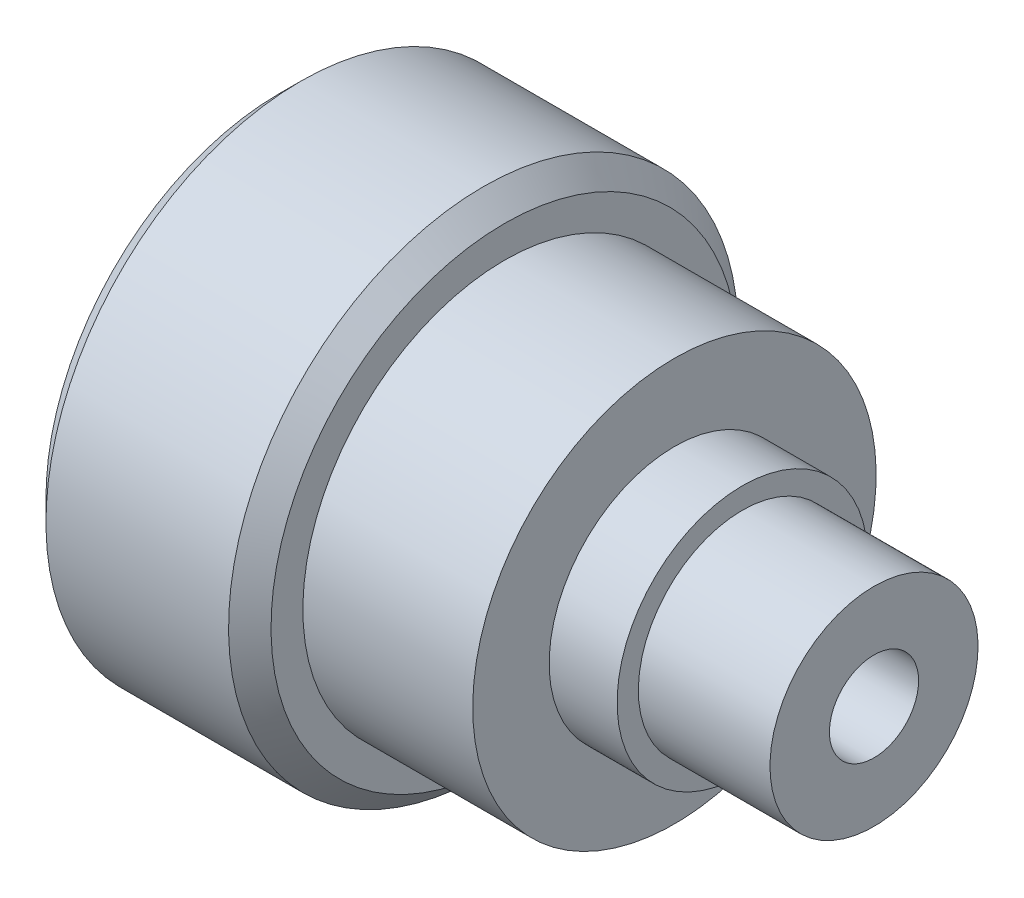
ISO-10303-21;
HEADER;
FILE_DESCRIPTION(('STEP AP214'),'2;1');
FILE_NAME('part.step','',(''),(''),'','','');
FILE_SCHEMA(('AUTOMOTIVE_DESIGN { 1 0 10303 214 1 1 1 1 }'));
ENDSEC;
DATA;
#1=APPLICATION_CONTEXT('core data for automotive mechanical design processes');
#2=APPLICATION_PROTOCOL_DEFINITION('international standard','automotive_design',2000,#1);
#3=PRODUCT_CONTEXT('',#1,'mechanical');
#4=PRODUCT('Part','Part','',(#3));
#5=PRODUCT_RELATED_PRODUCT_CATEGORY('part','',(#4));
#6=PRODUCT_DEFINITION_FORMATION('','',#4);
#7=PRODUCT_DEFINITION_CONTEXT('part definition',#1,'design');
#8=PRODUCT_DEFINITION('design','',#6,#7);
#9=PRODUCT_DEFINITION_SHAPE('','',#8);
#10=(LENGTH_UNIT() NAMED_UNIT(*) SI_UNIT(.MILLI.,.METRE.));
#11=(NAMED_UNIT(*) PLANE_ANGLE_UNIT() SI_UNIT($,.RADIAN.));
#12=(NAMED_UNIT(*) SI_UNIT($,.STERADIAN.) SOLID_ANGLE_UNIT());
#13=UNCERTAINTY_MEASURE_WITH_UNIT(LENGTH_MEASURE(1.E-05),#10,'distance_accuracy_value','');
#14=(GEOMETRIC_REPRESENTATION_CONTEXT(3) GLOBAL_UNCERTAINTY_ASSIGNED_CONTEXT((#13)) GLOBAL_UNIT_ASSIGNED_CONTEXT((#10,
#11,#12)) REPRESENTATION_CONTEXT('',''));
#15=CARTESIAN_POINT('',(0.,0.,0.));
#16=DIRECTION('',(0.,0.,1.));
#17=DIRECTION('',(1.,0.,0.));
#18=AXIS2_PLACEMENT_3D('',#15,#16,#17);
#19=CARTESIAN_POINT('',(1.,0.,0.));
#20=DIRECTION('',(1.,0.,0.));
#21=DIRECTION('',(0.,1.,0.));
#22=AXIS2_PLACEMENT_3D('',#19,#20,#21);
#23=CONICAL_SURFACE('',#22,12.,0.785398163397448);
#24=CARTESIAN_POINT('',(0.,0.,0.));
#25=DIRECTION('',(1.,0.,0.));
#26=DIRECTION('',(0.,1.,0.));
#27=AXIS2_PLACEMENT_3D('',#24,#25,#26);
#28=CIRCLE('',#27,11.);
#29=CARTESIAN_POINT('',(0.,11.,0.));
#30=VERTEX_POINT('',#29);
#31=EDGE_CURVE('E69',#30,#30,#28,.T.);
#32=ORIENTED_EDGE('',*,*,#31,.T.);
#33=EDGE_LOOP('',(#32));
#34=FACE_BOUND('',#33,.T.);
#35=CARTESIAN_POINT('',(1.,0.,0.));
#36=DIRECTION('',(1.,0.,0.));
#37=DIRECTION('',(0.,1.,0.));
#38=AXIS2_PLACEMENT_3D('',#35,#36,#37);
#39=CIRCLE('',#38,12.);
#40=CARTESIAN_POINT('',(1.,12.,0.));
#41=VERTEX_POINT('',#40);
#42=EDGE_CURVE('E10',#41,#41,#39,.T.);
#43=ORIENTED_EDGE('',*,*,#42,.F.);
#44=EDGE_LOOP('',(#43));
#45=FACE_BOUND('',#44,.T.);
#46=ADVANCED_FACE('F29',(#34,#45),#23,.T.);
#47=CARTESIAN_POINT('',(28.,0.,0.));
#48=DIRECTION('',(1.,0.,0.));
#49=DIRECTION('',(0.,1.,0.));
#50=AXIS2_PLACEMENT_3D('',#47,#48,#49);
#51=CYLINDRICAL_SURFACE('',#50,12.);
#52=ORIENTED_EDGE('',*,*,#42,.T.);
#53=EDGE_LOOP('',(#52));
#54=FACE_BOUND('',#53,.T.);
#55=CARTESIAN_POINT('',(9.6,0.,0.));
#56=DIRECTION('',(1.,0.,0.));
#57=DIRECTION('',(0.,1.,0.));
#58=AXIS2_PLACEMENT_3D('',#55,#56,#57);
#59=CIRCLE('',#58,12.);
#60=CARTESIAN_POINT('',(9.6,12.,0.));
#61=VERTEX_POINT('',#60);
#62=EDGE_CURVE('E35',#61,#61,#59,.T.);
#63=ORIENTED_EDGE('',*,*,#62,.F.);
#64=EDGE_LOOP('',(#63));
#65=FACE_BOUND('',#64,.T.);
#66=ADVANCED_FACE('F100',(#54,#65),#51,.T.);
#67=CARTESIAN_POINT('',(10.6,0.,0.));
#68=DIRECTION('',(-1.,0.,0.));
#69=DIRECTION('',(0.,-1.,0.));
#70=AXIS2_PLACEMENT_3D('',#67,#68,#69);
#71=CONICAL_SURFACE('',#70,11.,0.785398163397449);
#72=ORIENTED_EDGE('',*,*,#62,.T.);
#73=EDGE_LOOP('',(#72));
#74=FACE_BOUND('',#73,.T.);
#75=CARTESIAN_POINT('',(10.6,0.,0.));
#76=DIRECTION('',(1.,0.,0.));
#77=DIRECTION('',(0.,1.,0.));
#78=AXIS2_PLACEMENT_3D('',#75,#76,#77);
#79=CIRCLE('',#78,11.);
#80=CARTESIAN_POINT('',(10.6,11.,0.));
#81=VERTEX_POINT('',#80);
#82=EDGE_CURVE('E39',#81,#81,#79,.T.);
#83=ORIENTED_EDGE('',*,*,#82,.F.);
#84=EDGE_LOOP('',(#83));
#85=FACE_BOUND('',#84,.T.);
#86=ADVANCED_FACE('F105',(#74,#85),#71,.T.);
#87=CARTESIAN_POINT('',(10.6,11.,0.));
#88=DIRECTION('',(1.,0.,0.));
#89=DIRECTION('',(0.,1.,0.));
#90=AXIS2_PLACEMENT_3D('',#87,#88,#89);
#91=PLANE('',#90);
#92=ORIENTED_EDGE('',*,*,#82,.T.);
#93=EDGE_LOOP('',(#92));
#94=FACE_BOUND('',#93,.T.);
#95=CARTESIAN_POINT('',(10.6,0.,0.));
#96=DIRECTION('',(1.,0.,0.));
#97=DIRECTION('',(0.,1.,0.));
#98=AXIS2_PLACEMENT_3D('',#95,#96,#97);
#99=CIRCLE('',#98,9.5);
#100=CARTESIAN_POINT('',(10.6,9.5,0.));
#101=VERTEX_POINT('',#100);
#102=EDGE_CURVE('E43',#101,#101,#99,.T.);
#103=ORIENTED_EDGE('',*,*,#102,.F.);
#104=EDGE_LOOP('',(#103));
#105=FACE_BOUND('',#104,.T.);
#106=ADVANCED_FACE('F187',(#94,#105),#91,.T.);
#107=CARTESIAN_POINT('',(28.,0.,0.));
#108=DIRECTION('',(1.,0.,0.));
#109=DIRECTION('',(0.,1.,0.));
#110=AXIS2_PLACEMENT_3D('',#107,#108,#109);
#111=CYLINDRICAL_SURFACE('',#110,9.5);
#112=ORIENTED_EDGE('',*,*,#102,.T.);
#113=EDGE_LOOP('',(#112));
#114=FACE_BOUND('',#113,.T.);
#115=CARTESIAN_POINT('',(18.6,0.,0.));
#116=DIRECTION('',(1.,0.,0.));
#117=DIRECTION('',(0.,1.,0.));
#118=AXIS2_PLACEMENT_3D('',#115,#116,#117);
#119=CIRCLE('',#118,9.5);
#120=CARTESIAN_POINT('',(18.6,9.5,0.));
#121=VERTEX_POINT('',#120);
#122=EDGE_CURVE('E48',#121,#121,#119,.T.);
#123=ORIENTED_EDGE('',*,*,#122,.F.);
#124=EDGE_LOOP('',(#123));
#125=FACE_BOUND('',#124,.T.);
#126=ADVANCED_FACE('F178',(#114,#125),#111,.T.);
#127=CARTESIAN_POINT('',(18.6,9.5,0.));
#128=DIRECTION('',(1.,0.,0.));
#129=DIRECTION('',(0.,1.,0.));
#130=AXIS2_PLACEMENT_3D('',#127,#128,#129);
#131=PLANE('',#130);
#132=ORIENTED_EDGE('',*,*,#122,.T.);
#133=EDGE_LOOP('',(#132));
#134=FACE_BOUND('',#133,.T.);
#135=CARTESIAN_POINT('',(18.6,0.,0.));
#136=DIRECTION('',(1.,0.,0.));
#137=DIRECTION('',(0.,1.,0.));
#138=AXIS2_PLACEMENT_3D('',#135,#136,#137);
#139=CIRCLE('',#138,5.89999999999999);
#140=CARTESIAN_POINT('',(18.6,5.89999999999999,0.));
#141=VERTEX_POINT('',#140);
#142=EDGE_CURVE('E51',#141,#141,#139,.T.);
#143=ORIENTED_EDGE('',*,*,#142,.F.);
#144=EDGE_LOOP('',(#143));
#145=FACE_BOUND('',#144,.T.);
#146=ADVANCED_FACE('F169',(#134,#145),#131,.T.);
#147=CARTESIAN_POINT('',(28.,0.,0.));
#148=DIRECTION('',(1.,0.,0.));
#149=DIRECTION('',(0.,1.,0.));
#150=AXIS2_PLACEMENT_3D('',#147,#148,#149);
#151=CYLINDRICAL_SURFACE('',#150,5.89999999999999);
#152=ORIENTED_EDGE('',*,*,#142,.T.);
#153=EDGE_LOOP('',(#152));
#154=FACE_BOUND('',#153,.T.);
#155=CARTESIAN_POINT('',(21.8,0.,0.));
#156=DIRECTION('',(1.,0.,0.));
#157=DIRECTION('',(0.,1.,0.));
#158=AXIS2_PLACEMENT_3D('',#155,#156,#157);
#159=CIRCLE('',#158,5.89999999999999);
#160=CARTESIAN_POINT('',(21.8,5.89999999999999,0.));
#161=VERTEX_POINT('',#160);
#162=EDGE_CURVE('E54',#161,#161,#159,.T.);
#163=ORIENTED_EDGE('',*,*,#162,.F.);
#164=EDGE_LOOP('',(#163));
#165=FACE_BOUND('',#164,.T.);
#166=ADVANCED_FACE('F96',(#154,#165),#151,.T.);
#167=CARTESIAN_POINT('',(21.8,5.89999999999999,0.));
#168=DIRECTION('',(1.,0.,0.));
#169=DIRECTION('',(0.,1.,0.));
#170=AXIS2_PLACEMENT_3D('',#167,#168,#169);
#171=PLANE('',#170);
#172=ORIENTED_EDGE('',*,*,#162,.T.);
#173=EDGE_LOOP('',(#172));
#174=FACE_BOUND('',#173,.T.);
#175=CARTESIAN_POINT('',(21.8,0.,0.));
#176=DIRECTION('',(1.,0.,0.));
#177=DIRECTION('',(0.,1.,0.));
#178=AXIS2_PLACEMENT_3D('',#175,#176,#177);
#179=CIRCLE('',#178,4.9);
#180=CARTESIAN_POINT('',(21.8,4.9,0.));
#181=VERTEX_POINT('',#180);
#182=EDGE_CURVE('E57',#181,#181,#179,.T.);
#183=ORIENTED_EDGE('',*,*,#182,.F.);
#184=EDGE_LOOP('',(#183));
#185=FACE_BOUND('',#184,.T.);
#186=ADVANCED_FACE('F90',(#174,#185),#171,.T.);
#187=CARTESIAN_POINT('',(28.,0.,0.));
#188=DIRECTION('',(1.,0.,0.));
#189=DIRECTION('',(0.,1.,0.));
#190=AXIS2_PLACEMENT_3D('',#187,#188,#189);
#191=CYLINDRICAL_SURFACE('',#190,4.9);
#192=ORIENTED_EDGE('',*,*,#182,.T.);
#193=EDGE_LOOP('',(#192));
#194=FACE_BOUND('',#193,.T.);
#195=CARTESIAN_POINT('',(28.,0.,0.));
#196=DIRECTION('',(1.,0.,0.));
#197=DIRECTION('',(0.,1.,0.));
#198=AXIS2_PLACEMENT_3D('',#195,#196,#197);
#199=CIRCLE('',#198,4.9);
#200=CARTESIAN_POINT('',(28.,4.9,0.));
#201=VERTEX_POINT('',#200);
#202=EDGE_CURVE('E60',#201,#201,#199,.T.);
#203=ORIENTED_EDGE('',*,*,#202,.F.);
#204=EDGE_LOOP('',(#203));
#205=FACE_BOUND('',#204,.T.);
#206=ADVANCED_FACE('F85',(#194,#205),#191,.T.);
#207=CARTESIAN_POINT('',(28.,4.9,0.));
#208=DIRECTION('',(1.,0.,0.));
#209=DIRECTION('',(0.,1.,0.));
#210=AXIS2_PLACEMENT_3D('',#207,#208,#209);
#211=PLANE('',#210);
#212=CARTESIAN_POINT('',(28.,0.,0.));
#213=DIRECTION('',(1.,0.,0.));
#214=DIRECTION('',(0.,0.,-1.));
#215=AXIS2_PLACEMENT_3D('',#212,#213,#214);
#216=CIRCLE('',#215,2.09999999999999);
#217=CARTESIAN_POINT('',(28.,0.,-2.09999999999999));
#218=VERTEX_POINT('',#217);
#219=EDGE_CURVE('E75',#218,#218,#216,.T.);
#220=ORIENTED_EDGE('',*,*,#219,.F.);
#221=EDGE_LOOP('',(#220));
#222=FACE_BOUND('',#221,.T.);
#223=ORIENTED_EDGE('',*,*,#202,.T.);
#224=EDGE_LOOP('',(#223));
#225=FACE_BOUND('',#224,.T.);
#226=ADVANCED_FACE('F81',(#222,#225),#211,.T.);
#227=CARTESIAN_POINT('',(18.6,2.49999999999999,0.));
#228=DIRECTION('',(-1.,0.,0.));
#229=DIRECTION('',(0.,-1.,0.));
#230=AXIS2_PLACEMENT_3D('',#227,#228,#229);
#231=PLANE('',#230);
#232=CARTESIAN_POINT('',(18.6,0.,0.));
#233=DIRECTION('',(1.,0.,0.));
#234=DIRECTION('',(0.,0.,-1.));
#235=AXIS2_PLACEMENT_3D('',#232,#233,#234);
#236=CIRCLE('',#235,2.1);
#237=CARTESIAN_POINT('',(18.6,0.,-2.1));
#238=VERTEX_POINT('',#237);
#239=EDGE_CURVE('E72',#238,#238,#236,.T.);
#240=ORIENTED_EDGE('',*,*,#239,.T.);
#241=EDGE_LOOP('',(#240));
#242=FACE_BOUND('',#241,.T.);
#243=CARTESIAN_POINT('',(18.6,0.,0.));
#244=DIRECTION('',(1.,0.,0.));
#245=DIRECTION('',(0.,1.,0.));
#246=AXIS2_PLACEMENT_3D('',#243,#244,#245);
#247=CIRCLE('',#246,2.49999999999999);
#248=CARTESIAN_POINT('',(18.6,2.49999999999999,0.));
#249=VERTEX_POINT('',#248);
#250=EDGE_CURVE('E63',#249,#249,#247,.T.);
#251=ORIENTED_EDGE('',*,*,#250,.F.);
#252=EDGE_LOOP('',(#251));
#253=FACE_BOUND('',#252,.T.);
#254=ADVANCED_FACE('F84',(#242,#253),#231,.T.);
#255=CARTESIAN_POINT('',(28.,0.,0.));
#256=DIRECTION('',(1.,0.,0.));
#257=DIRECTION('',(0.,1.,0.));
#258=AXIS2_PLACEMENT_3D('',#255,#256,#257);
#259=CYLINDRICAL_SURFACE('',#258,2.49999999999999);
#260=ORIENTED_EDGE('',*,*,#250,.T.);
#261=EDGE_LOOP('',(#260));
#262=FACE_BOUND('',#261,.T.);
#263=CARTESIAN_POINT('',(0.,0.,0.));
#264=DIRECTION('',(1.,0.,0.));
#265=DIRECTION('',(0.,1.,0.));
#266=AXIS2_PLACEMENT_3D('',#263,#264,#265);
#267=CIRCLE('',#266,2.49999999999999);
#268=CARTESIAN_POINT('',(0.,2.49999999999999,0.));
#269=VERTEX_POINT('',#268);
#270=EDGE_CURVE('E66',#269,#269,#267,.T.);
#271=ORIENTED_EDGE('',*,*,#270,.F.);
#272=EDGE_LOOP('',(#271));
#273=FACE_BOUND('',#272,.T.);
#274=ADVANCED_FACE('F111',(#262,#273),#259,.F.);
#275=CARTESIAN_POINT('',(0.,2.49999999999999,0.));
#276=DIRECTION('',(-1.,0.,0.));
#277=DIRECTION('',(0.,-1.,0.));
#278=AXIS2_PLACEMENT_3D('',#275,#276,#277);
#279=PLANE('',#278);
#280=ORIENTED_EDGE('',*,*,#270,.T.);
#281=EDGE_LOOP('',(#280));
#282=FACE_BOUND('',#281,.T.);
#283=ORIENTED_EDGE('',*,*,#31,.F.);
#284=EDGE_LOOP('',(#283));
#285=FACE_BOUND('',#284,.T.);
#286=ADVANCED_FACE('F109',(#282,#285),#279,.T.);
#287=CARTESIAN_POINT('',(28.,0.,0.));
#288=DIRECTION('',(1.,0.,0.));
#289=DIRECTION('',(0.,0.,-1.));
#290=AXIS2_PLACEMENT_3D('',#287,#288,#289);
#291=CYLINDRICAL_SURFACE('',#290,2.09999999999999);
#292=ORIENTED_EDGE('',*,*,#239,.F.);
#293=EDGE_LOOP('',(#292));
#294=FACE_BOUND('',#293,.T.);
#295=ORIENTED_EDGE('',*,*,#219,.T.);
#296=EDGE_LOOP('',(#295));
#297=FACE_BOUND('',#296,.T.);
#298=ADVANCED_FACE('F79',(#294,#297),#291,.F.);
#299=CLOSED_SHELL('',(#46,#66,#86,#106,#126,#146,#166,#186,#206,#226,#254,#274,#286,#298));
#300=MANIFOLD_SOLID_BREP('B2',#299);
#301=ADVANCED_BREP_SHAPE_REPRESENTATION('',(#18,#300),#14);
#302=SHAPE_DEFINITION_REPRESENTATION(#9,#301);
ENDSEC;
END-ISO-10303-21;
